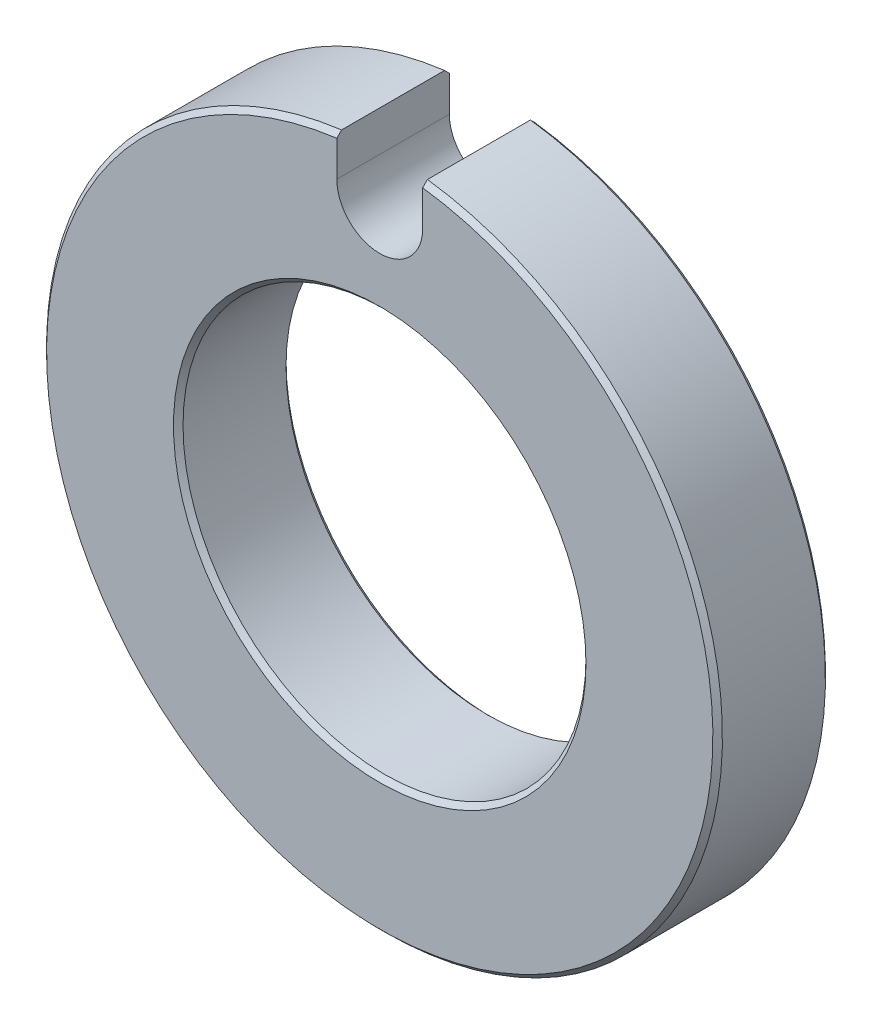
from build123d import *

# Parameters (mm, degrees)
SKETCH1_R           = 18
SKETCH1_R_2         = 10.7315
BOSS_EXTRUDE1_DEPTH = 5.9944
CHAMFER1_SIZE       = 0.254
CUT_EXTRUDE1_DEPTH  = 27.152109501


with BuildPart() as part:
    # Sketch1 → Boss-Extrude1 (new body)
    with BuildSketch(Plane.XY):
        with Locations(Location((0, 0, 0), (0, 0, 180))):
            Circle(SKETCH1_R)
        with Locations(Location((0, 0, 0), (0, 0, 180))):
            Circle(SKETCH1_R_2, mode=Mode.SUBTRACT)
    extrude(amount=BOSS_EXTRUDE1_DEPTH)

    # Chamfer1
    chamfer1_edges = [part.edges().sort_by_distance(p)[0] for p in [
        (18, 0, 0),
        (18, 0, 5.9944),
        (10.7315, 0, 0),
        (10.7315, 0, 5.9944),
    ]]
    chamfer(chamfer1_edges, length=CHAMFER1_SIZE)

    # Sketch2 → Cut-Extrude1 (cut, through all)
    with BuildSketch(Plane.XY):
        with BuildLine():
            Line((-2.286, 15.7099), (-2.286, 19.5199))
            Line((-2.286, 19.5199), (2.286, 19.5199))
            Line((2.286, 19.5199), (2.286, 15.7099))
            ThreePointArc((2.286, 15.7099), (0, 13.4239), (-2.286, 15.7099))
        make_face()
    extrude(amount=CUT_EXTRUDE1_DEPTH, mode=Mode.SUBTRACT)


solid = part.part
